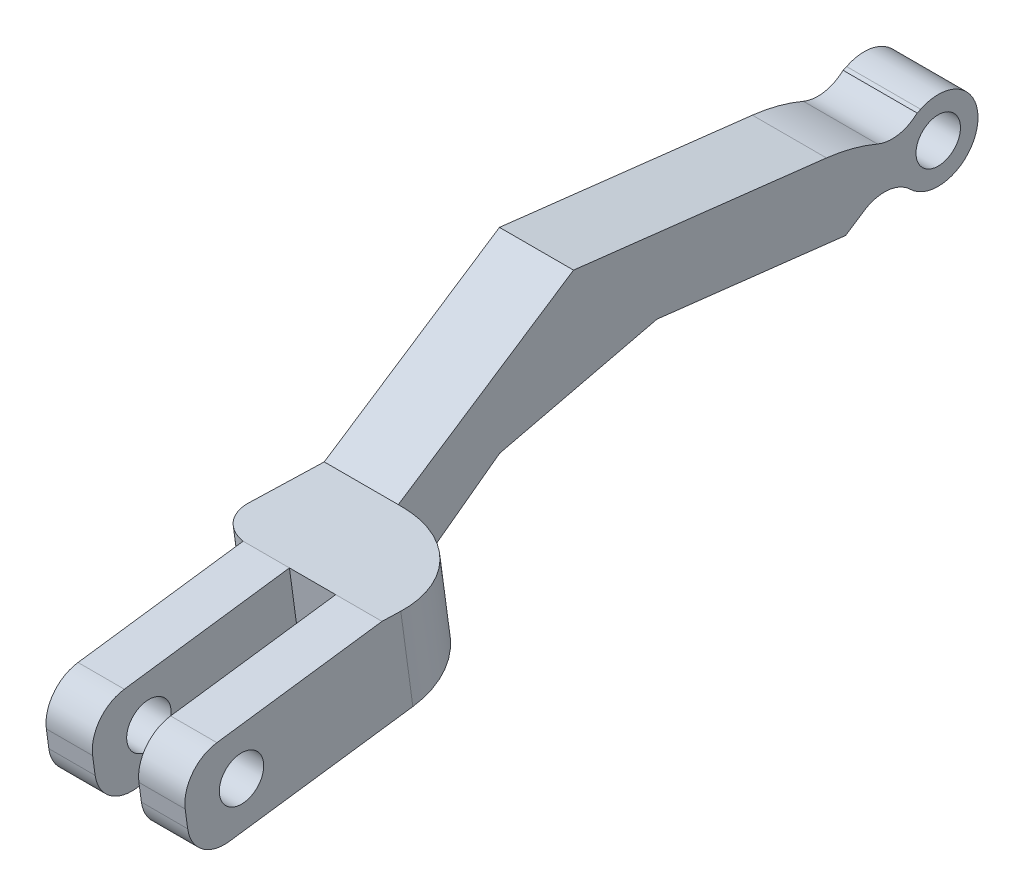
ISO-10303-21;
HEADER;
FILE_DESCRIPTION(('STEP AP214'),'2;1');
FILE_NAME('part.step','',(''),(''),'','','');
FILE_SCHEMA(('AUTOMOTIVE_DESIGN { 1 0 10303 214 1 1 1 1 }'));
ENDSEC;
DATA;
#1=APPLICATION_CONTEXT('core data for automotive mechanical design processes');
#2=APPLICATION_PROTOCOL_DEFINITION('international standard','automotive_design',2000,#1);
#3=PRODUCT_CONTEXT('',#1,'mechanical');
#4=PRODUCT('Part','Part','',(#3));
#5=PRODUCT_RELATED_PRODUCT_CATEGORY('part','',(#4));
#6=PRODUCT_DEFINITION_FORMATION('','',#4);
#7=PRODUCT_DEFINITION_CONTEXT('part definition',#1,'design');
#8=PRODUCT_DEFINITION('design','',#6,#7);
#9=PRODUCT_DEFINITION_SHAPE('','',#8);
#10=(LENGTH_UNIT() NAMED_UNIT(*) SI_UNIT(.MILLI.,.METRE.));
#11=(NAMED_UNIT(*) PLANE_ANGLE_UNIT() SI_UNIT($,.RADIAN.));
#12=(NAMED_UNIT(*) SI_UNIT($,.STERADIAN.) SOLID_ANGLE_UNIT());
#13=UNCERTAINTY_MEASURE_WITH_UNIT(LENGTH_MEASURE(1.E-05),#10,'distance_accuracy_value','');
#14=(GEOMETRIC_REPRESENTATION_CONTEXT(3) GLOBAL_UNCERTAINTY_ASSIGNED_CONTEXT((#13)) GLOBAL_UNIT_ASSIGNED_CONTEXT((#10,
#11,#12)) REPRESENTATION_CONTEXT('',''));
#15=CARTESIAN_POINT('',(0.,0.,0.));
#16=DIRECTION('',(0.,0.,1.));
#17=DIRECTION('',(1.,0.,0.));
#18=AXIS2_PLACEMENT_3D('',#15,#16,#17);
#19=CARTESIAN_POINT('',(2.2,0.,0.));
#20=DIRECTION('',(1.,0.,0.));
#21=DIRECTION('',(0.,0.,-1.));
#22=AXIS2_PLACEMENT_3D('',#19,#20,#21);
#23=PLANE('',#22);
#24=CARTESIAN_POINT('',(2.2,-8.66025403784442,40.));
#25=DIRECTION('',(1.,0.,0.));
#26=DIRECTION('',(0.,0.,-1.));
#27=AXIS2_PLACEMENT_3D('',#24,#25,#26);
#28=CIRCLE('',#27,1.2);
#29=CARTESIAN_POINT('',(2.2,-8.66025403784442,38.8));
#30=VERTEX_POINT('',#29);
#31=EDGE_CURVE('E268',#30,#30,#28,.T.);
#32=ORIENTED_EDGE('',*,*,#31,.F.);
#33=EDGE_LOOP('',(#32));
#34=FACE_BOUND('',#33,.T.);
#35=DIRECTION('',(0.,-0.990856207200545,-0.134922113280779));
#36=VECTOR('',#35,1.);
#37=CARTESIAN_POINT('',(2.2,-5.90995393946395,43.4021851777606));
#38=LINE('',#37,#36);
#39=CARTESIAN_POINT('',(2.2,-8.56959227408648,43.040029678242));
#40=VERTEX_POINT('',#39);
#41=CARTESIAN_POINT('',(2.2,-9.56044848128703,42.9051075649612));
#42=VERTEX_POINT('',#41);
#43=EDGE_CURVE('E283',#40,#42,#38,.T.);
#44=ORIENTED_EDGE('',*,*,#43,.T.);
#45=CARTESIAN_POINT('',(2.2,-9.29060425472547,40.9233951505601));
#46=DIRECTION('',(1.,0.,0.));
#47=DIRECTION('',(0.,0.,-1.));
#48=AXIS2_PLACEMENT_3D('',#45,#46,#47);
#49=CIRCLE('',#48,2.);
#50=CARTESIAN_POINT('',(2.2,-11.2723166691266,40.6535509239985));
#51=VERTEX_POINT('',#50);
#52=EDGE_CURVE('E416',#42,#51,#49,.T.);
#53=ORIENTED_EDGE('',*,*,#52,.T.);
#54=DIRECTION('',(0.,-0.134922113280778,0.990856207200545));
#55=VECTOR('',#54,1.);
#56=CARTESIAN_POINT('',(2.2,-5.6322069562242,-0.766921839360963));
#57=LINE('',#56,#55);
#58=CARTESIAN_POINT('',(2.2,-10.0580176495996,31.7358450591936));
#59=VERTEX_POINT('',#58);
#60=EDGE_CURVE('E263',#59,#51,#57,.T.);
#61=ORIENTED_EDGE('',*,*,#60,.F.);
#62=DIRECTION('',(0.,0.990856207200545,0.134922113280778));
#63=VECTOR('',#62,1.);
#64=CARTESIAN_POINT('',(2.2,-4.42581069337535,32.5027668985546));
#65=LINE('',#64,#63);
#66=CARTESIAN_POINT('',(2.2,-5.10373661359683,32.4104556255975));
#67=VERTEX_POINT('',#66);
#68=EDGE_CURVE('E227',#59,#67,#65,.T.);
#69=ORIENTED_EDGE('',*,*,#68,.T.);
#70=DIRECTION('',(0.,-0.134922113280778,0.990856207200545));
#71=VECTOR('',#70,1.);
#72=CARTESIAN_POINT('',(2.2,-0.67792592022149,-0.092311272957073));
#73=LINE('',#72,#71);
#74=CARTESIAN_POINT('',(2.2,-6.31803563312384,41.3281614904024));
#75=VERTEX_POINT('',#74);
#76=EDGE_CURVE('E280',#67,#75,#73,.T.);
#77=ORIENTED_EDGE('',*,*,#76,.T.);
#78=CARTESIAN_POINT('',(2.2,-8.29974804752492,41.0583172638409));
#79=DIRECTION('',(1.,0.,0.));
#80=DIRECTION('',(0.,0.,-1.));
#81=AXIS2_PLACEMENT_3D('',#78,#79,#80);
#82=CIRCLE('',#81,2.);
#83=EDGE_CURVE('E414',#75,#40,#82,.T.);
#84=ORIENTED_EDGE('',*,*,#83,.T.);
#85=EDGE_LOOP('',(#44,#53,#61,#69,#77,#84));
#86=FACE_BOUND('',#85,.T.);
#87=ADVANCED_FACE('F41',(#34,#86),#23,.T.);
#88=CARTESIAN_POINT('',(2.,0.,0.));
#89=DIRECTION('',(1.,0.,0.));
#90=DIRECTION('',(0.,0.,-1.));
#91=AXIS2_PLACEMENT_3D('',#88,#89,#90);
#92=PLANE('',#91);
#93=CARTESIAN_POINT('',(2.,-2.82842712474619,-2.82842712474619));
#94=DIRECTION('',(1.,0.,0.));
#95=DIRECTION('',(0.,0.,-1.));
#96=AXIS2_PLACEMENT_3D('',#93,#94,#95);
#97=CIRCLE('',#96,1.2);
#98=CARTESIAN_POINT('',(2.,-2.82842712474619,-4.02842712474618));
#99=VERTEX_POINT('',#98);
#100=EDGE_CURVE('E322',#99,#99,#97,.T.);
#101=ORIENTED_EDGE('',*,*,#100,.F.);
#102=EDGE_LOOP('',(#101));
#103=FACE_BOUND('',#102,.T.);
#104=CARTESIAN_POINT('',(2.,0.484049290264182,-0.328427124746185));
#105=DIRECTION('',(1.,0.,0.));
#106=DIRECTION('',(0.,0.,-1.));
#107=AXIS2_PLACEMENT_3D('',#104,#105,#106);
#108=CIRCLE('',#107,2.);
#109=CARTESIAN_POINT('',(2.,-1.35709444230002,0.452719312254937));
#110=VERTEX_POINT('',#109);
#111=CARTESIAN_POINT('',(2.,-0.979731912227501,-1.69127142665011));
#112=VERTEX_POINT('',#111);
#113=EDGE_CURVE('E298',#110,#112,#108,.T.);
#114=ORIENTED_EDGE('',*,*,#113,.F.);
#115=CARTESIAN_POINT('',(2.,-10.562813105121,4.35845149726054));
#116=DIRECTION('',(1.,0.,0.));
#117=DIRECTION('',(0.,0.,-1.));
#118=AXIS2_PLACEMENT_3D('',#115,#116,#117);
#119=CIRCLE('',#118,10.);
#120=CARTESIAN_POINT('',(2.,-0.629231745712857,3.20781629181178));
#121=VERTEX_POINT('',#120);
#122=EDGE_CURVE('E63',#110,#121,#119,.T.);
#123=ORIENTED_EDGE('',*,*,#122,.T.);
#124=DIRECTION('',(0.,0.115063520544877,0.993358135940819));
#125=VECTOR('',#124,1.);
#126=CARTESIAN_POINT('',(2.,-0.987552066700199,0.114390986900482));
#127=LINE('',#126,#125);
#128=CARTESIAN_POINT('',(2.,0.952983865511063,16.8672866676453));
#129=VERTEX_POINT('',#128);
#130=EDGE_CURVE('E300',#121,#129,#127,.T.);
#131=ORIENTED_EDGE('',*,*,#130,.T.);
#132=DIRECTION('',(0.,-0.550374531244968,0.834917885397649));
#133=VECTOR('',#132,1.);
#134=CARTESIAN_POINT('',(2.,8.41512757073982,5.54721844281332));
#135=LINE('',#134,#133);
#136=CARTESIAN_POINT('',(2.,-5.28506014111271,26.3303962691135));
#137=VERTEX_POINT('',#136);
#138=EDGE_CURVE('E302',#129,#137,#135,.T.);
#139=ORIENTED_EDGE('',*,*,#138,.T.);
#140=DIRECTION('',(0.,-0.990856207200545,-0.134922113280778));
#141=VECTOR('',#140,1.);
#142=CARTESIAN_POINT('',(2.,-3.61627801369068,26.5576296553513));
#143=LINE('',#142,#141);
#144=CARTESIAN_POINT('',(2.,-9.24848496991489,25.7907078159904));
#145=VERTEX_POINT('',#144);
#146=EDGE_CURVE('E359',#137,#145,#143,.T.);
#147=ORIENTED_EDGE('',*,*,#146,.T.);
#148=DIRECTION('',(0.,-0.592706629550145,0.805418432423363));
#149=VECTOR('',#148,1.);
#150=CARTESIAN_POINT('',(2.,6.31240513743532,4.64529271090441));
#151=LINE('',#150,#149);
#152=CARTESIAN_POINT('',(2.,-5.61916698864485,20.8588925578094));
#153=VERTEX_POINT('',#152);
#154=EDGE_CURVE('E305',#153,#145,#151,.T.);
#155=ORIENTED_EDGE('',*,*,#154,.F.);
#156=DIRECTION('',(0.,-0.231624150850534,0.972805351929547));
#157=VECTOR('',#156,1.);
#158=CARTESIAN_POINT('',(2.,-5.61916698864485,20.8588925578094));
#159=LINE('',#158,#157);
#160=CARTESIAN_POINT('',(2.,-3.59576628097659,12.3607500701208));
#161=VERTEX_POINT('',#160);
#162=EDGE_CURVE('E431',#153,#161,#159,.F.);
#163=ORIENTED_EDGE('',*,*,#162,.T.);
#164=DIRECTION('',(0.,0.115063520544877,0.993358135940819));
#165=VECTOR('',#164,1.);
#166=CARTESIAN_POINT('',(2.,-4.96098461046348,0.574645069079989));
#167=LINE('',#166,#165);
#168=CARTESIAN_POINT('',(2.,-4.77600788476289,2.17157287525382));
#169=VERTEX_POINT('',#168);
#170=EDGE_CURVE('E307',#169,#161,#167,.T.);
#171=ORIENTED_EDGE('',*,*,#170,.F.);
#172=DIRECTION('',(0.,0.550374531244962,-0.834917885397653));
#173=VECTOR('',#172,1.);
#174=CARTESIAN_POINT('',(2.,-2.33142136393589,-1.53686363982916));
#175=LINE('',#174,#173);
#176=CARTESIAN_POINT('',(2.,-4.12127803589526,1.17834802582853));
#177=VERTEX_POINT('',#176);
#178=EDGE_CURVE('E310',#169,#177,#175,.T.);
#179=ORIENTED_EDGE('',*,*,#178,.T.);
#180=CARTESIAN_POINT('',(2.,-5.79111380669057,0.0775989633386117));
#181=DIRECTION('',(1.,0.,0.));
#182=DIRECTION('',(0.,0.,-1.));
#183=AXIS2_PLACEMENT_3D('',#180,#181,#182);
#184=CIRCLE('',#183,2.);
#185=CARTESIAN_POINT('',(2.,-4.36331299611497,-1.32289553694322));
#186=VERTEX_POINT('',#185);
#187=EDGE_CURVE('E313',#186,#177,#184,.T.);
#188=ORIENTED_EDGE('',*,*,#187,.F.);
#189=CARTESIAN_POINT('',(2.,-2.82842712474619,-2.82842712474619));
#190=DIRECTION('',(1.,0.,0.));
#191=DIRECTION('',(0.,0.,-1.));
#192=AXIS2_PLACEMENT_3D('',#189,#190,#191);
#193=CIRCLE('',#192,2.15);
#194=CARTESIAN_POINT('',(2.,-0.898489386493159,-1.88088275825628));
#195=VERTEX_POINT('',#194);
#196=EDGE_CURVE('E316',#186,#195,#193,.T.);
#197=ORIENTED_EDGE('',*,*,#196,.T.);
#198=CARTESIAN_POINT('',(2.,0.896801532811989,-0.999446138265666));
#199=DIRECTION('',(1.,0.,0.));
#200=DIRECTION('',(0.,0.,-1.));
#201=AXIS2_PLACEMENT_3D('',#198,#199,#200);
#202=CIRCLE('',#201,2.);
#203=EDGE_CURVE('E319',#112,#195,#202,.T.);
#204=ORIENTED_EDGE('',*,*,#203,.F.);
#205=EDGE_LOOP('',(#114,#123,#131,#139,#147,#155,#163,#171,#179,#188,#197,#204));
#206=FACE_BOUND('',#205,.T.);
#207=ADVANCED_FACE('F446',(#103,#206),#92,.T.);
#208=CARTESIAN_POINT('',(-2.,0.484049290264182,-0.328427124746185));
#209=DIRECTION('',(1.,0.,0.));
#210=DIRECTION('',(0.,0.,-1.));
#211=AXIS2_PLACEMENT_3D('',#208,#209,#210);
#212=CYLINDRICAL_SURFACE('',#211,2.);
#213=CARTESIAN_POINT('',(-2.,0.484049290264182,-0.328427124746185));
#214=DIRECTION('',(1.,0.,0.));
#215=DIRECTION('',(0.,0.,-1.));
#216=AXIS2_PLACEMENT_3D('',#213,#214,#215);
#217=CIRCLE('',#216,2.);
#218=CARTESIAN_POINT('',(-2.,-1.35709444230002,0.452719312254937));
#219=VERTEX_POINT('',#218);
#220=CARTESIAN_POINT('',(-2.,-0.979731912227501,-1.69127142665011));
#221=VERTEX_POINT('',#220);
#222=EDGE_CURVE('E325',#219,#221,#217,.T.);
#223=ORIENTED_EDGE('',*,*,#222,.F.);
#224=DIRECTION('',(1.,0.,0.));
#225=VECTOR('',#224,1.);
#226=CARTESIAN_POINT('',(-2.,-1.35709444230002,0.452719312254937));
#227=LINE('',#226,#225);
#228=EDGE_CURVE('E435',#219,#110,#227,.T.);
#229=ORIENTED_EDGE('',*,*,#228,.T.);
#230=ORIENTED_EDGE('',*,*,#113,.T.);
#231=DIRECTION('',(1.,0.,0.));
#232=VECTOR('',#231,1.);
#233=CARTESIAN_POINT('',(-2.,-0.979731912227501,-1.69127142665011));
#234=LINE('',#233,#232);
#235=EDGE_CURVE('E356',#221,#112,#234,.T.);
#236=ORIENTED_EDGE('',*,*,#235,.F.);
#237=EDGE_LOOP('',(#223,#229,#230,#236));
#238=FACE_BOUND('',#237,.T.);
#239=ADVANCED_FACE('F441',(#238),#212,.F.);
#240=CARTESIAN_POINT('',(-2.,0.896801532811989,-0.999446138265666));
#241=DIRECTION('',(1.,0.,0.));
#242=DIRECTION('',(0.,0.,-1.));
#243=AXIS2_PLACEMENT_3D('',#240,#241,#242);
#244=CYLINDRICAL_SURFACE('',#243,2.);
#245=ORIENTED_EDGE('',*,*,#235,.T.);
#246=ORIENTED_EDGE('',*,*,#203,.T.);
#247=DIRECTION('',(1.,0.,0.));
#248=VECTOR('',#247,1.);
#249=CARTESIAN_POINT('',(-2.,-0.898489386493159,-1.88088275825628));
#250=LINE('',#249,#248);
#251=CARTESIAN_POINT('',(-2.,-0.898489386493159,-1.88088275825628));
#252=VERTEX_POINT('',#251);
#253=EDGE_CURVE('E360',#252,#195,#250,.T.);
#254=ORIENTED_EDGE('',*,*,#253,.F.);
#255=CARTESIAN_POINT('',(-2.,0.896801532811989,-0.999446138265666));
#256=DIRECTION('',(1.,0.,0.));
#257=DIRECTION('',(0.,0.,-1.));
#258=AXIS2_PLACEMENT_3D('',#255,#256,#257);
#259=CIRCLE('',#258,2.);
#260=EDGE_CURVE('E350',#221,#252,#259,.T.);
#261=ORIENTED_EDGE('',*,*,#260,.F.);
#262=EDGE_LOOP('',(#245,#246,#254,#261));
#263=FACE_BOUND('',#262,.T.);
#264=ADVANCED_FACE('F451',(#263),#244,.F.);
#265=CARTESIAN_POINT('',(-2.,-2.82842712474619,-2.82842712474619));
#266=DIRECTION('',(1.,0.,0.));
#267=DIRECTION('',(0.,0.,-1.));
#268=AXIS2_PLACEMENT_3D('',#265,#266,#267);
#269=CYLINDRICAL_SURFACE('',#268,2.15);
#270=ORIENTED_EDGE('',*,*,#253,.T.);
#271=ORIENTED_EDGE('',*,*,#196,.F.);
#272=DIRECTION('',(1.,0.,0.));
#273=VECTOR('',#272,1.);
#274=CARTESIAN_POINT('',(-2.,-4.36331299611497,-1.32289553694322));
#275=LINE('',#274,#273);
#276=CARTESIAN_POINT('',(-2.,-4.36331299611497,-1.32289553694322));
#277=VERTEX_POINT('',#276);
#278=EDGE_CURVE('E362',#277,#186,#275,.T.);
#279=ORIENTED_EDGE('',*,*,#278,.F.);
#280=CARTESIAN_POINT('',(-2.,-2.82842712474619,-2.82842712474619));
#281=DIRECTION('',(1.,0.,0.));
#282=DIRECTION('',(0.,0.,-1.));
#283=AXIS2_PLACEMENT_3D('',#280,#281,#282);
#284=CIRCLE('',#283,2.15);
#285=EDGE_CURVE('E347',#277,#252,#284,.T.);
#286=ORIENTED_EDGE('',*,*,#285,.T.);
#287=EDGE_LOOP('',(#270,#271,#279,#286));
#288=FACE_BOUND('',#287,.T.);
#289=ADVANCED_FACE('F504',(#288),#269,.T.);
#290=CARTESIAN_POINT('',(-2.,-5.79111380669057,0.0775989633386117));
#291=DIRECTION('',(1.,0.,0.));
#292=DIRECTION('',(0.,0.,-1.));
#293=AXIS2_PLACEMENT_3D('',#290,#291,#292);
#294=CYLINDRICAL_SURFACE('',#293,2.);
#295=ORIENTED_EDGE('',*,*,#278,.T.);
#296=ORIENTED_EDGE('',*,*,#187,.T.);
#297=DIRECTION('',(1.,0.,0.));
#298=VECTOR('',#297,1.);
#299=CARTESIAN_POINT('',(-2.,-4.12127803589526,1.17834802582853));
#300=LINE('',#299,#298);
#301=CARTESIAN_POINT('',(-2.,-4.12127803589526,1.17834802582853));
#302=VERTEX_POINT('',#301);
#303=EDGE_CURVE('E364',#302,#177,#300,.T.);
#304=ORIENTED_EDGE('',*,*,#303,.F.);
#305=CARTESIAN_POINT('',(-2.,-5.79111380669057,0.0775989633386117));
#306=DIRECTION('',(1.,0.,0.));
#307=DIRECTION('',(0.,0.,-1.));
#308=AXIS2_PLACEMENT_3D('',#305,#306,#307);
#309=CIRCLE('',#308,2.);
#310=EDGE_CURVE('E345',#277,#302,#309,.T.);
#311=ORIENTED_EDGE('',*,*,#310,.F.);
#312=EDGE_LOOP('',(#295,#296,#304,#311));
#313=FACE_BOUND('',#312,.T.);
#314=ADVANCED_FACE('F507',(#313),#294,.F.);
#315=CARTESIAN_POINT('',(-2.,-2.33142136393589,-1.53686363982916));
#316=DIRECTION('',(0.,-0.834917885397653,-0.550374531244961));
#317=DIRECTION('',(0.,0.550374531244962,-0.834917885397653));
#318=AXIS2_PLACEMENT_3D('',#315,#316,#317);
#319=PLANE('',#318);
#320=ORIENTED_EDGE('',*,*,#303,.T.);
#321=ORIENTED_EDGE('',*,*,#178,.F.);
#322=DIRECTION('',(1.,0.,0.));
#323=VECTOR('',#322,1.);
#324=CARTESIAN_POINT('',(-2.,-4.77600788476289,2.17157287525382));
#325=LINE('',#324,#323);
#326=CARTESIAN_POINT('',(-2.,-4.77600788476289,2.17157287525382));
#327=VERTEX_POINT('',#326);
#328=EDGE_CURVE('E366',#327,#169,#325,.T.);
#329=ORIENTED_EDGE('',*,*,#328,.F.);
#330=DIRECTION('',(0.,0.550374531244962,-0.834917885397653));
#331=VECTOR('',#330,1.);
#332=CARTESIAN_POINT('',(-2.,-2.33142136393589,-1.53686363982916));
#333=LINE('',#332,#331);
#334=EDGE_CURVE('E342',#327,#302,#333,.T.);
#335=ORIENTED_EDGE('',*,*,#334,.T.);
#336=EDGE_LOOP('',(#320,#321,#329,#335));
#337=FACE_BOUND('',#336,.T.);
#338=ADVANCED_FACE('F511',(#337),#319,.T.);
#339=CARTESIAN_POINT('',(-2.,-4.96098461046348,0.574645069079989));
#340=DIRECTION('',(0.,0.993358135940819,-0.115063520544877));
#341=DIRECTION('',(0.,0.115063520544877,0.993358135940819));
#342=AXIS2_PLACEMENT_3D('',#339,#340,#341);
#343=PLANE('',#342);
#344=ORIENTED_EDGE('',*,*,#170,.T.);
#345=DIRECTION('',(-1.,0.,0.));
#346=VECTOR('',#345,1.);
#347=CARTESIAN_POINT('',(-2.,-3.59576628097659,12.3607500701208));
#348=LINE('',#347,#346);
#349=CARTESIAN_POINT('',(-2.,-3.59576628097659,12.3607500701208));
#350=VERTEX_POINT('',#349);
#351=EDGE_CURVE('E429',#161,#350,#348,.T.);
#352=ORIENTED_EDGE('',*,*,#351,.T.);
#353=DIRECTION('',(0.,0.115063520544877,0.993358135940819));
#354=VECTOR('',#353,1.);
#355=CARTESIAN_POINT('',(-2.,-4.96098461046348,0.574645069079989));
#356=LINE('',#355,#354);
#357=EDGE_CURVE('E339',#327,#350,#356,.T.);
#358=ORIENTED_EDGE('',*,*,#357,.F.);
#359=ORIENTED_EDGE('',*,*,#328,.T.);
#360=EDGE_LOOP('',(#344,#352,#358,#359));
#361=FACE_BOUND('',#360,.T.);
#362=ADVANCED_FACE('F515',(#361),#343,.F.);
#363=CARTESIAN_POINT('',(-2.,6.31240513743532,4.64529271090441));
#364=DIRECTION('',(0.,0.805418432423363,0.592706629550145));
#365=DIRECTION('',(0.,-0.592706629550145,0.805418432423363));
#366=AXIS2_PLACEMENT_3D('',#363,#364,#365);
#367=PLANE('',#366);
#368=DIRECTION('',(0.,-0.592706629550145,0.805418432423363));
#369=VECTOR('',#368,1.);
#370=CARTESIAN_POINT('',(-2.,6.31240513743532,4.64529271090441));
#371=LINE('',#370,#369);
#372=CARTESIAN_POINT('',(-2.,-5.61916698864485,20.8588925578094));
#373=VERTEX_POINT('',#372);
#374=CARTESIAN_POINT('',(-2.,-9.24848496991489,25.7907078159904));
#375=VERTEX_POINT('',#374);
#376=EDGE_CURVE('E337',#373,#375,#371,.T.);
#377=ORIENTED_EDGE('',*,*,#376,.F.);
#378=DIRECTION('',(1.,0.,0.));
#379=VECTOR('',#378,1.);
#380=CARTESIAN_POINT('',(2.,-5.61916698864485,20.8588925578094));
#381=LINE('',#380,#379);
#382=EDGE_CURVE('E426',#373,#153,#381,.T.);
#383=ORIENTED_EDGE('',*,*,#382,.T.);
#384=ORIENTED_EDGE('',*,*,#154,.T.);
#385=DIRECTION('',(1.,0.,0.));
#386=VECTOR('',#385,1.);
#387=CARTESIAN_POINT('',(-2.,-9.24848496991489,25.7907078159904));
#388=LINE('',#387,#386);
#389=EDGE_CURVE('E368',#375,#145,#388,.T.);
#390=ORIENTED_EDGE('',*,*,#389,.F.);
#391=EDGE_LOOP('',(#377,#383,#384,#390));
#392=FACE_BOUND('',#391,.T.);
#393=ADVANCED_FACE('F519',(#392),#367,.F.);
#394=CARTESIAN_POINT('',(-2.,-5.6322069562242,-0.766921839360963));
#395=DIRECTION('',(0.,0.990856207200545,0.134922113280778));
#396=DIRECTION('',(0.,-0.134922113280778,0.990856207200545));
#397=AXIS2_PLACEMENT_3D('',#394,#395,#396);
#398=PLANE('',#397);
#399=DIRECTION('',(0.,-0.134922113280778,0.990856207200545));
#400=VECTOR('',#399,1.);
#401=CARTESIAN_POINT('',(7.2,-5.6322069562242,-0.766921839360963));
#402=LINE('',#401,#400);
#403=CARTESIAN_POINT('',(7.2,-9.92309553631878,30.7449888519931));
#404=VERTEX_POINT('',#403);
#405=CARTESIAN_POINT('',(7.2,-11.2723166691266,40.6535509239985));
#406=VERTEX_POINT('',#405);
#407=EDGE_CURVE('E254',#404,#406,#402,.T.);
#408=ORIENTED_EDGE('',*,*,#407,.T.);
#409=DIRECTION('',(-1.,0.,0.));
#410=VECTOR('',#409,1.);
#411=CARTESIAN_POINT('',(-2.,-11.2723166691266,40.6535509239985));
#412=LINE('',#411,#410);
#413=CARTESIAN_POINT('',(4.7,-11.2723166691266,40.6535509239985));
#414=VERTEX_POINT('',#413);
#415=EDGE_CURVE('E393',#406,#414,#412,.T.);
#416=ORIENTED_EDGE('',*,*,#415,.T.);
#417=DIRECTION('',(0.,-0.134922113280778,0.990856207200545));
#418=VECTOR('',#417,1.);
#419=CARTESIAN_POINT('',(4.7,-5.6322069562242,-0.766921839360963));
#420=LINE('',#419,#418);
#421=CARTESIAN_POINT('',(4.7,-10.0580176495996,31.7358450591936));
#422=VERTEX_POINT('',#421);
#423=EDGE_CURVE('E246',#422,#414,#420,.T.);
#424=ORIENTED_EDGE('',*,*,#423,.F.);
#425=DIRECTION('',(-1.,0.,0.));
#426=VECTOR('',#425,1.);
#427=CARTESIAN_POINT('',(4.7,-10.0580176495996,31.7358450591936));
#428=LINE('',#427,#426);
#429=EDGE_CURVE('E258',#422,#59,#428,.T.);
#430=ORIENTED_EDGE('',*,*,#429,.T.);
#431=ORIENTED_EDGE('',*,*,#60,.T.);
#432=DIRECTION('',(1.,0.,0.));
#433=VECTOR('',#432,1.);
#434=CARTESIAN_POINT('',(-0.3,-11.2723166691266,40.6535509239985));
#435=LINE('',#434,#433);
#436=CARTESIAN_POINT('',(-0.3,-11.2723166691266,40.6535509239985));
#437=VERTEX_POINT('',#436);
#438=EDGE_CURVE('E391',#51,#437,#435,.F.);
#439=ORIENTED_EDGE('',*,*,#438,.T.);
#440=DIRECTION('',(0.,-0.134922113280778,0.990856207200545));
#441=VECTOR('',#440,1.);
#442=CARTESIAN_POINT('',(-0.3,-5.6322069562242,-0.766921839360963));
#443=LINE('',#442,#441);
#444=CARTESIAN_POINT('',(-0.3,-10.0580176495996,31.7358450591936));
#445=VERTEX_POINT('',#444);
#446=EDGE_CURVE('E264',#445,#437,#443,.T.);
#447=ORIENTED_EDGE('',*,*,#446,.F.);
#448=CARTESIAN_POINT('',(0.,-9.79122644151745,29.7765537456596));
#449=DIRECTION('',(0.,0.990856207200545,0.134922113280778));
#450=DIRECTION('',(0.,-0.134922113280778,0.990856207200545));
#451=AXIS2_PLACEMENT_3D('',#448,#449,#450);
#452=CIRCLE('',#451,2.);
#453=CARTESIAN_POINT('',(-2.,-9.79122644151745,29.7765537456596));
#454=VERTEX_POINT('',#453);
#455=EDGE_CURVE('E377',#445,#454,#452,.F.);
#456=ORIENTED_EDGE('',*,*,#455,.T.);
#457=DIRECTION('',(0.,-0.134922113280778,0.990856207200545));
#458=VECTOR('',#457,1.);
#459=CARTESIAN_POINT('',(-2.,-5.6322069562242,-0.766921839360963));
#460=LINE('',#459,#458);
#461=EDGE_CURVE('E334',#375,#454,#460,.T.);
#462=ORIENTED_EDGE('',*,*,#461,.F.);
#463=ORIENTED_EDGE('',*,*,#389,.T.);
#464=DIRECTION('',(1.,0.,0.));
#465=VECTOR('',#464,1.);
#466=CARTESIAN_POINT('',(-0.3,-9.24848496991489,25.7907078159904));
#467=LINE('',#466,#465);
#468=CARTESIAN_POINT('',(2.2,-9.24848496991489,25.7907078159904));
#469=VERTEX_POINT('',#468);
#470=EDGE_CURVE('E277',#145,#469,#467,.T.);
#471=ORIENTED_EDGE('',*,*,#470,.T.);
#472=CARTESIAN_POINT('',(2.2,-9.92309553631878,30.7449888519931));
#473=DIRECTION('',(0.,0.990856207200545,0.134922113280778));
#474=DIRECTION('',(0.,-0.134922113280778,0.990856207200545));
#475=AXIS2_PLACEMENT_3D('',#472,#473,#474);
#476=CIRCLE('',#475,5.);
#477=EDGE_CURVE('E386',#469,#404,#476,.F.);
#478=ORIENTED_EDGE('',*,*,#477,.T.);
#479=EDGE_LOOP('',(#408,#416,#424,#430,#431,#439,#447,#456,#462,#463,#471,#478));
#480=FACE_BOUND('',#479,.T.);
#481=ADVANCED_FACE('F523',(#480),#398,.F.);
#482=CARTESIAN_POINT('',(-2.,-6.06490845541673,0.180871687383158));
#483=DIRECTION('',(0.,-0.99955560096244,0.0298094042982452));
#484=DIRECTION('',(0.,-0.0298094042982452,-0.99955560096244));
#485=AXIS2_PLACEMENT_3D('',#482,#483,#484);
#486=PLANE('',#485);
#487=DIRECTION('',(0.,-0.0298094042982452,-0.99955560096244));
#488=VECTOR('',#487,1.);
#489=CARTESIAN_POINT('',(7.2,-6.06490845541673,0.180871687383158));
#490=LINE('',#489,#488);
#491=CARTESIAN_POINT('',(7.2,-5.10373661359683,32.4104556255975));
#492=VERTEX_POINT('',#491);
#493=CARTESIAN_POINT('',(7.2,-5.13395720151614,31.3971123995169));
#494=VERTEX_POINT('',#493);
#495=EDGE_CURVE('E220',#492,#494,#490,.T.);
#496=ORIENTED_EDGE('',*,*,#495,.T.);
#497=CARTESIAN_POINT('',(2.2,-5.13395720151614,31.3971123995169));
#498=DIRECTION('',(0.,-0.99955560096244,0.0298094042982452));
#499=DIRECTION('',(0.,0.0298094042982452,0.99955560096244));
#500=AXIS2_PLACEMENT_3D('',#497,#498,#499);
#501=ELLIPSE('',#500,5.06896877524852,5.);
#502=CARTESIAN_POINT('',(2.2,-5.28506014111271,26.3303962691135));
#503=VERTEX_POINT('',#502);
#504=EDGE_CURVE('E389',#494,#503,#501,.F.);
#505=ORIENTED_EDGE('',*,*,#504,.T.);
#506=DIRECTION('',(1.,0.,0.));
#507=VECTOR('',#506,1.);
#508=CARTESIAN_POINT('',(-0.3,-5.28506014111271,26.3303962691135));
#509=LINE('',#508,#507);
#510=EDGE_CURVE('E291',#137,#503,#509,.T.);
#511=ORIENTED_EDGE('',*,*,#510,.F.);
#512=DIRECTION('',(1.,0.,0.));
#513=VECTOR('',#512,1.);
#514=CARTESIAN_POINT('',(-2.,-5.28506014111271,26.3303962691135));
#515=LINE('',#514,#513);
#516=CARTESIAN_POINT('',(-2.,-5.28506014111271,26.3303962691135));
#517=VERTEX_POINT('',#516);
#518=EDGE_CURVE('E371',#517,#137,#515,.T.);
#519=ORIENTED_EDGE('',*,*,#518,.F.);
#520=DIRECTION('',(0.,-0.0298094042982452,-0.99955560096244));
#521=VECTOR('',#520,1.);
#522=CARTESIAN_POINT('',(-2.,-6.06490845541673,0.180871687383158));
#523=LINE('',#522,#521);
#524=CARTESIAN_POINT('',(-2.,-5.1634939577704,30.4066991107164));
#525=VERTEX_POINT('',#524);
#526=EDGE_CURVE('E332',#525,#517,#523,.T.);
#527=ORIENTED_EDGE('',*,*,#526,.F.);
#528=CARTESIAN_POINT('',(0.,-5.1634939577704,30.4066991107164));
#529=DIRECTION('',(0.,-0.99955560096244,0.0298094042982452));
#530=DIRECTION('',(0.,0.0298094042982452,0.99955560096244));
#531=AXIS2_PLACEMENT_3D('',#528,#529,#530);
#532=ELLIPSE('',#531,2.02758751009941,2.);
#533=CARTESIAN_POINT('',(-0.3,-5.10373661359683,32.4104556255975));
#534=VERTEX_POINT('',#533);
#535=EDGE_CURVE('E381',#525,#534,#532,.F.);
#536=ORIENTED_EDGE('',*,*,#535,.T.);
#537=DIRECTION('',(1.,0.,0.));
#538=VECTOR('',#537,1.);
#539=CARTESIAN_POINT('',(-0.3,-5.10373661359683,32.4104556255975));
#540=LINE('',#539,#538);
#541=EDGE_CURVE('E288',#534,#67,#540,.T.);
#542=ORIENTED_EDGE('',*,*,#541,.T.);
#543=DIRECTION('',(-1.,0.,0.));
#544=VECTOR('',#543,1.);
#545=CARTESIAN_POINT('',(4.7,-5.10373661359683,32.4104556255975));
#546=LINE('',#545,#544);
#547=CARTESIAN_POINT('',(4.7,-5.10373661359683,32.4104556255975));
#548=VERTEX_POINT('',#547);
#549=EDGE_CURVE('E223',#548,#67,#546,.T.);
#550=ORIENTED_EDGE('',*,*,#549,.F.);
#551=DIRECTION('',(-1.,0.,0.));
#552=VECTOR('',#551,1.);
#553=CARTESIAN_POINT('',(7.2,-5.10373661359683,32.4104556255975));
#554=LINE('',#553,#552);
#555=EDGE_CURVE('E216',#492,#548,#554,.T.);
#556=ORIENTED_EDGE('',*,*,#555,.F.);
#557=EDGE_LOOP('',(#496,#505,#511,#519,#527,#536,#542,#550,#556));
#558=FACE_BOUND('',#557,.T.);
#559=ADVANCED_FACE('F218',(#558),#486,.F.);
#560=CARTESIAN_POINT('',(-2.,8.41512757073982,5.54721844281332));
#561=DIRECTION('',(0.,0.834917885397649,0.550374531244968));
#562=DIRECTION('',(0.,-0.550374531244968,0.834917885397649));
#563=AXIS2_PLACEMENT_3D('',#560,#561,#562);
#564=PLANE('',#563);
#565=ORIENTED_EDGE('',*,*,#518,.T.);
#566=ORIENTED_EDGE('',*,*,#138,.F.);
#567=DIRECTION('',(1.,0.,0.));
#568=VECTOR('',#567,1.);
#569=CARTESIAN_POINT('',(-2.,0.952983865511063,16.8672866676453));
#570=LINE('',#569,#568);
#571=CARTESIAN_POINT('',(-2.,0.952983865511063,16.8672866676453));
#572=VERTEX_POINT('',#571);
#573=EDGE_CURVE('E355',#572,#129,#570,.T.);
#574=ORIENTED_EDGE('',*,*,#573,.F.);
#575=DIRECTION('',(0.,-0.550374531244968,0.834917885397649));
#576=VECTOR('',#575,1.);
#577=CARTESIAN_POINT('',(-2.,8.41512757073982,5.54721844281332));
#578=LINE('',#577,#576);
#579=EDGE_CURVE('E329',#572,#517,#578,.T.);
#580=ORIENTED_EDGE('',*,*,#579,.T.);
#581=EDGE_LOOP('',(#565,#566,#574,#580));
#582=FACE_BOUND('',#581,.T.);
#583=ADVANCED_FACE('F530',(#582),#564,.T.);
#584=CARTESIAN_POINT('',(-2.,-0.987552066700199,0.114390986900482));
#585=DIRECTION('',(0.,0.993358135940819,-0.115063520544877));
#586=DIRECTION('',(0.,0.115063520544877,0.993358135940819));
#587=AXIS2_PLACEMENT_3D('',#584,#585,#586);
#588=PLANE('',#587);
#589=ORIENTED_EDGE('',*,*,#130,.F.);
#590=DIRECTION('',(-1.,0.,0.));
#591=VECTOR('',#590,1.);
#592=CARTESIAN_POINT('',(-2.,-0.629231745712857,3.20781629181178));
#593=LINE('',#592,#591);
#594=CARTESIAN_POINT('',(-2.,-0.629231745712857,3.20781629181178));
#595=VERTEX_POINT('',#594);
#596=EDGE_CURVE('E49',#121,#595,#593,.T.);
#597=ORIENTED_EDGE('',*,*,#596,.T.);
#598=DIRECTION('',(0.,0.115063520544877,0.993358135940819));
#599=VECTOR('',#598,1.);
#600=CARTESIAN_POINT('',(-2.,-0.987552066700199,0.114390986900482));
#601=LINE('',#600,#599);
#602=EDGE_CURVE('E327',#595,#572,#601,.T.);
#603=ORIENTED_EDGE('',*,*,#602,.T.);
#604=ORIENTED_EDGE('',*,*,#573,.T.);
#605=EDGE_LOOP('',(#589,#597,#603,#604));
#606=FACE_BOUND('',#605,.T.);
#607=ADVANCED_FACE('F500',(#606),#588,.T.);
#608=CARTESIAN_POINT('',(-2.,-2.82842712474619,-2.82842712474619));
#609=DIRECTION('',(1.,0.,0.));
#610=DIRECTION('',(0.,0.,-1.));
#611=AXIS2_PLACEMENT_3D('',#608,#609,#610);
#612=CYLINDRICAL_SURFACE('',#611,1.2);
#613=CARTESIAN_POINT('',(-2.,-2.82842712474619,-2.82842712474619));
#614=DIRECTION('',(1.,0.,0.));
#615=DIRECTION('',(0.,0.,-1.));
#616=AXIS2_PLACEMENT_3D('',#613,#614,#615);
#617=CIRCLE('',#616,1.2);
#618=CARTESIAN_POINT('',(-2.,-2.82842712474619,-4.02842712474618));
#619=VERTEX_POINT('',#618);
#620=EDGE_CURVE('E352',#619,#619,#617,.T.);
#621=ORIENTED_EDGE('',*,*,#620,.F.);
#622=EDGE_LOOP('',(#621));
#623=FACE_BOUND('',#622,.T.);
#624=ORIENTED_EDGE('',*,*,#100,.T.);
#625=EDGE_LOOP('',(#624));
#626=FACE_BOUND('',#625,.T.);
#627=ADVANCED_FACE('F497',(#623,#626),#612,.F.);
#628=CARTESIAN_POINT('',(-2.,0.,0.));
#629=DIRECTION('',(1.,0.,0.));
#630=DIRECTION('',(0.,0.,-1.));
#631=AXIS2_PLACEMENT_3D('',#628,#629,#630);
#632=PLANE('',#631);
#633=ORIENTED_EDGE('',*,*,#602,.F.);
#634=CARTESIAN_POINT('',(-2.,-10.562813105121,4.35845149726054));
#635=DIRECTION('',(1.,0.,0.));
#636=DIRECTION('',(0.,0.,-1.));
#637=AXIS2_PLACEMENT_3D('',#634,#635,#636);
#638=CIRCLE('',#637,10.);
#639=EDGE_CURVE('E11',#595,#219,#638,.F.);
#640=ORIENTED_EDGE('',*,*,#639,.T.);
#641=ORIENTED_EDGE('',*,*,#222,.T.);
#642=ORIENTED_EDGE('',*,*,#260,.T.);
#643=ORIENTED_EDGE('',*,*,#285,.F.);
#644=ORIENTED_EDGE('',*,*,#310,.T.);
#645=ORIENTED_EDGE('',*,*,#334,.F.);
#646=ORIENTED_EDGE('',*,*,#357,.T.);
#647=DIRECTION('',(0.,0.231624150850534,-0.972805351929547));
#648=VECTOR('',#647,1.);
#649=CARTESIAN_POINT('',(-2.,-0.617665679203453,-0.147065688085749));
#650=LINE('',#649,#648);
#651=EDGE_CURVE('E433',#350,#373,#650,.F.);
#652=ORIENTED_EDGE('',*,*,#651,.T.);
#653=ORIENTED_EDGE('',*,*,#376,.T.);
#654=ORIENTED_EDGE('',*,*,#461,.T.);
#655=DIRECTION('',(0.,0.990856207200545,0.134922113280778));
#656=VECTOR('',#655,1.);
#657=CARTESIAN_POINT('',(-2.,-4.15901948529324,30.5434755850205));
#658=LINE('',#657,#656);
#659=EDGE_CURVE('E379',#454,#525,#658,.T.);
#660=ORIENTED_EDGE('',*,*,#659,.T.);
#661=ORIENTED_EDGE('',*,*,#526,.T.);
#662=ORIENTED_EDGE('',*,*,#579,.F.);
#663=EDGE_LOOP('',(#633,#640,#641,#642,#643,#644,#645,#646,#652,#653,#654,#660,#661,#662));
#664=FACE_BOUND('',#663,.T.);
#665=ORIENTED_EDGE('',*,*,#620,.T.);
#666=EDGE_LOOP('',(#665));
#667=FACE_BOUND('',#666,.T.);
#668=ADVANCED_FACE('F455',(#664,#667),#632,.F.);
#669=CARTESIAN_POINT('',(-0.3,-5.90995393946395,43.4021851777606));
#670=DIRECTION('',(0.,-0.134922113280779,0.990856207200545));
#671=DIRECTION('',(0.,-0.990856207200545,-0.134922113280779));
#672=AXIS2_PLACEMENT_3D('',#669,#670,#671);
#673=PLANE('',#672);
#674=DIRECTION('',(0.,-0.990856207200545,-0.134922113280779));
#675=VECTOR('',#674,1.);
#676=CARTESIAN_POINT('',(-0.3,-5.90995393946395,43.4021851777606));
#677=LINE('',#676,#675);
#678=CARTESIAN_POINT('',(-0.3,-8.56959227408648,43.040029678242));
#679=VERTEX_POINT('',#678);
#680=CARTESIAN_POINT('',(-0.3,-9.56044848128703,42.9051075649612));
#681=VERTEX_POINT('',#680);
#682=EDGE_CURVE('E271',#679,#681,#677,.T.);
#683=ORIENTED_EDGE('',*,*,#682,.T.);
#684=DIRECTION('',(1.,0.,0.));
#685=VECTOR('',#684,1.);
#686=CARTESIAN_POINT('',(2.2,-9.56044848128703,42.9051075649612));
#687=LINE('',#686,#685);
#688=EDGE_CURVE('E411',#681,#42,#687,.T.);
#689=ORIENTED_EDGE('',*,*,#688,.T.);
#690=ORIENTED_EDGE('',*,*,#43,.F.);
#691=DIRECTION('',(1.,0.,0.));
#692=VECTOR('',#691,1.);
#693=CARTESIAN_POINT('',(-0.3,-8.56959227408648,43.040029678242));
#694=LINE('',#693,#692);
#695=EDGE_CURVE('E409',#40,#679,#694,.F.);
#696=ORIENTED_EDGE('',*,*,#695,.T.);
#697=EDGE_LOOP('',(#683,#689,#690,#696));
#698=FACE_BOUND('',#697,.T.);
#699=ADVANCED_FACE('F484',(#698),#673,.T.);
#700=CARTESIAN_POINT('',(-0.3,-0.67792592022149,-0.092311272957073));
#701=DIRECTION('',(0.,0.990856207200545,0.134922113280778));
#702=DIRECTION('',(0.,-0.134922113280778,0.990856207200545));
#703=AXIS2_PLACEMENT_3D('',#700,#701,#702);
#704=PLANE('',#703);
#705=DIRECTION('',(0.,-0.134922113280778,0.990856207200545));
#706=VECTOR('',#705,1.);
#707=CARTESIAN_POINT('',(-0.3,-0.67792592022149,-0.092311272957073));
#708=LINE('',#707,#706);
#709=CARTESIAN_POINT('',(-0.3,-6.31803563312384,41.3281614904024));
#710=VERTEX_POINT('',#709);
#711=EDGE_CURVE('E267',#534,#710,#708,.T.);
#712=ORIENTED_EDGE('',*,*,#711,.T.);
#713=DIRECTION('',(1.,0.,0.));
#714=VECTOR('',#713,1.);
#715=CARTESIAN_POINT('',(-0.3,-6.31803563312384,41.3281614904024));
#716=LINE('',#715,#714);
#717=EDGE_CURVE('E422',#710,#75,#716,.T.);
#718=ORIENTED_EDGE('',*,*,#717,.T.);
#719=ORIENTED_EDGE('',*,*,#76,.F.);
#720=ORIENTED_EDGE('',*,*,#541,.F.);
#721=EDGE_LOOP('',(#712,#718,#719,#720));
#722=FACE_BOUND('',#721,.T.);
#723=ADVANCED_FACE('F487',(#722),#704,.T.);
#724=CARTESIAN_POINT('',(-0.3,-3.61627801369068,26.5576296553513));
#725=DIRECTION('',(0.,-0.134922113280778,0.990856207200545));
#726=DIRECTION('',(0.,-0.990856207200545,-0.134922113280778));
#727=AXIS2_PLACEMENT_3D('',#724,#725,#726);
#728=PLANE('',#727);
#729=ORIENTED_EDGE('',*,*,#510,.T.);
#730=DIRECTION('',(0.,-0.990856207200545,-0.134922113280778));
#731=VECTOR('',#730,1.);
#732=CARTESIAN_POINT('',(2.2,-9.24848496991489,25.7907078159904));
#733=LINE('',#732,#731);
#734=EDGE_CURVE('E383',#503,#469,#733,.T.);
#735=ORIENTED_EDGE('',*,*,#734,.T.);
#736=ORIENTED_EDGE('',*,*,#470,.F.);
#737=ORIENTED_EDGE('',*,*,#146,.F.);
#738=EDGE_LOOP('',(#729,#735,#736,#737));
#739=FACE_BOUND('',#738,.T.);
#740=ADVANCED_FACE('F482',(#739),#728,.F.);
#741=CARTESIAN_POINT('',(-0.3,-8.66025403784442,40.));
#742=DIRECTION('',(1.,0.,0.));
#743=DIRECTION('',(0.,0.,-1.));
#744=AXIS2_PLACEMENT_3D('',#741,#742,#743);
#745=CYLINDRICAL_SURFACE('',#744,1.2);
#746=CARTESIAN_POINT('',(-0.3,-8.66025403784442,40.));
#747=DIRECTION('',(1.,0.,0.));
#748=DIRECTION('',(0.,0.,-1.));
#749=AXIS2_PLACEMENT_3D('',#746,#747,#748);
#750=CIRCLE('',#749,1.2);
#751=CARTESIAN_POINT('',(-0.3,-8.66025403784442,38.8));
#752=VERTEX_POINT('',#751);
#753=EDGE_CURVE('E274',#752,#752,#750,.T.);
#754=ORIENTED_EDGE('',*,*,#753,.F.);
#755=EDGE_LOOP('',(#754));
#756=FACE_BOUND('',#755,.T.);
#757=ORIENTED_EDGE('',*,*,#31,.T.);
#758=EDGE_LOOP('',(#757));
#759=FACE_BOUND('',#758,.T.);
#760=ADVANCED_FACE('F479',(#756,#759),#745,.F.);
#761=CARTESIAN_POINT('',(-0.3,0.,0.));
#762=DIRECTION('',(1.,0.,0.));
#763=DIRECTION('',(0.,0.,-1.));
#764=AXIS2_PLACEMENT_3D('',#761,#762,#763);
#765=PLANE('',#764);
#766=ORIENTED_EDGE('',*,*,#446,.T.);
#767=CARTESIAN_POINT('',(-0.3,-9.29060425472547,40.9233951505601));
#768=DIRECTION('',(1.,0.,0.));
#769=DIRECTION('',(0.,0.,-1.));
#770=AXIS2_PLACEMENT_3D('',#767,#768,#769);
#771=CIRCLE('',#770,2.);
#772=EDGE_CURVE('E420',#437,#681,#771,.F.);
#773=ORIENTED_EDGE('',*,*,#772,.T.);
#774=ORIENTED_EDGE('',*,*,#682,.F.);
#775=CARTESIAN_POINT('',(-0.3,-8.29974804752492,41.0583172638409));
#776=DIRECTION('',(1.,0.,0.));
#777=DIRECTION('',(0.,0.,-1.));
#778=AXIS2_PLACEMENT_3D('',#775,#776,#777);
#779=CIRCLE('',#778,2.);
#780=EDGE_CURVE('E418',#679,#710,#779,.F.);
#781=ORIENTED_EDGE('',*,*,#780,.T.);
#782=ORIENTED_EDGE('',*,*,#711,.F.);
#783=DIRECTION('',(0.,0.990856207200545,0.134922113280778));
#784=VECTOR('',#783,1.);
#785=CARTESIAN_POINT('',(-0.3,-4.42581069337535,32.5027668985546));
#786=LINE('',#785,#784);
#787=EDGE_CURVE('E290',#445,#534,#786,.T.);
#788=ORIENTED_EDGE('',*,*,#787,.F.);
#789=EDGE_LOOP('',(#766,#773,#774,#781,#782,#788));
#790=FACE_BOUND('',#789,.T.);
#791=ORIENTED_EDGE('',*,*,#753,.T.);
#792=EDGE_LOOP('',(#791));
#793=FACE_BOUND('',#792,.T.);
#794=ADVANCED_FACE('F477',(#790,#793),#765,.F.);
#795=CARTESIAN_POINT('',(4.7,-4.42581069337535,32.5027668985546));
#796=DIRECTION('',(0.,-0.134922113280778,0.990856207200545));
#797=DIRECTION('',(0.,-0.990856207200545,-0.134922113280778));
#798=AXIS2_PLACEMENT_3D('',#795,#796,#797);
#799=PLANE('',#798);
#800=ORIENTED_EDGE('',*,*,#68,.F.);
#801=ORIENTED_EDGE('',*,*,#429,.F.);
#802=DIRECTION('',(0.,0.990856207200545,0.134922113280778));
#803=VECTOR('',#802,1.);
#804=CARTESIAN_POINT('',(4.7,-4.42581069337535,32.5027668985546));
#805=LINE('',#804,#803);
#806=EDGE_CURVE('E256',#422,#548,#805,.T.);
#807=ORIENTED_EDGE('',*,*,#806,.T.);
#808=ORIENTED_EDGE('',*,*,#549,.T.);
#809=EDGE_LOOP('',(#800,#801,#807,#808));
#810=FACE_BOUND('',#809,.T.);
#811=ADVANCED_FACE('F599',(#810),#799,.T.);
#812=CARTESIAN_POINT('',(7.2,-0.67792592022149,-0.092311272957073));
#813=DIRECTION('',(0.,-0.990856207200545,-0.134922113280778));
#814=DIRECTION('',(0.,0.134922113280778,-0.990856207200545));
#815=AXIS2_PLACEMENT_3D('',#812,#813,#814);
#816=PLANE('',#815);
#817=DIRECTION('',(0.,-0.134922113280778,0.990856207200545));
#818=VECTOR('',#817,1.);
#819=CARTESIAN_POINT('',(4.7,-0.67792592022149,-0.092311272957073));
#820=LINE('',#819,#818);
#821=CARTESIAN_POINT('',(4.7,-6.31803563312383,41.3281614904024));
#822=VERTEX_POINT('',#821);
#823=EDGE_CURVE('E253',#548,#822,#820,.T.);
#824=ORIENTED_EDGE('',*,*,#823,.T.);
#825=DIRECTION('',(-1.,0.,0.));
#826=VECTOR('',#825,1.);
#827=CARTESIAN_POINT('',(7.2,-6.31803563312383,41.3281614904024));
#828=LINE('',#827,#826);
#829=CARTESIAN_POINT('',(7.2,-6.31803563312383,41.3281614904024));
#830=VERTEX_POINT('',#829);
#831=EDGE_CURVE('E233',#822,#830,#828,.F.);
#832=ORIENTED_EDGE('',*,*,#831,.T.);
#833=DIRECTION('',(0.,-0.134922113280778,0.990856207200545));
#834=VECTOR('',#833,1.);
#835=CARTESIAN_POINT('',(7.2,-0.67792592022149,-0.092311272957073));
#836=LINE('',#835,#834);
#837=EDGE_CURVE('E230',#492,#830,#836,.T.);
#838=ORIENTED_EDGE('',*,*,#837,.F.);
#839=ORIENTED_EDGE('',*,*,#555,.T.);
#840=EDGE_LOOP('',(#824,#832,#838,#839));
#841=FACE_BOUND('',#840,.T.);
#842=ADVANCED_FACE('F231',(#841),#816,.F.);
#843=CARTESIAN_POINT('',(7.2,-5.90995393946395,43.4021851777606));
#844=DIRECTION('',(0.,0.134922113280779,-0.990856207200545));
#845=DIRECTION('',(0.,0.990856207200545,0.134922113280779));
#846=AXIS2_PLACEMENT_3D('',#843,#844,#845);
#847=PLANE('',#846);
#848=DIRECTION('',(0.,-0.990856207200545,-0.134922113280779));
#849=VECTOR('',#848,1.);
#850=CARTESIAN_POINT('',(4.7,-5.90995393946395,43.4021851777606));
#851=LINE('',#850,#849);
#852=CARTESIAN_POINT('',(4.7,-8.56959227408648,43.040029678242));
#853=VERTEX_POINT('',#852);
#854=CARTESIAN_POINT('',(4.7,-9.56044848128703,42.9051075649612));
#855=VERTEX_POINT('',#854);
#856=EDGE_CURVE('E249',#853,#855,#851,.T.);
#857=ORIENTED_EDGE('',*,*,#856,.T.);
#858=DIRECTION('',(-1.,0.,0.));
#859=VECTOR('',#858,1.);
#860=CARTESIAN_POINT('',(7.2,-9.56044848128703,42.9051075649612));
#861=LINE('',#860,#859);
#862=CARTESIAN_POINT('',(7.2,-9.56044848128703,42.9051075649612));
#863=VERTEX_POINT('',#862);
#864=EDGE_CURVE('E403',#855,#863,#861,.F.);
#865=ORIENTED_EDGE('',*,*,#864,.T.);
#866=DIRECTION('',(0.,-0.990856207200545,-0.134922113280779));
#867=VECTOR('',#866,1.);
#868=CARTESIAN_POINT('',(7.2,-5.90995393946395,43.4021851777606));
#869=LINE('',#868,#867);
#870=CARTESIAN_POINT('',(7.2,-8.56959227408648,43.040029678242));
#871=VERTEX_POINT('',#870);
#872=EDGE_CURVE('E236',#871,#863,#869,.T.);
#873=ORIENTED_EDGE('',*,*,#872,.F.);
#874=DIRECTION('',(-1.,0.,0.));
#875=VECTOR('',#874,1.);
#876=CARTESIAN_POINT('',(7.2,-8.56959227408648,43.040029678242));
#877=LINE('',#876,#875);
#878=EDGE_CURVE('E400',#871,#853,#877,.T.);
#879=ORIENTED_EDGE('',*,*,#878,.T.);
#880=EDGE_LOOP('',(#857,#865,#873,#879));
#881=FACE_BOUND('',#880,.T.);
#882=ADVANCED_FACE('F570',(#881),#847,.F.);
#883=CARTESIAN_POINT('',(7.2,0.,0.));
#884=DIRECTION('',(1.,0.,0.));
#885=DIRECTION('',(0.,0.,-1.));
#886=AXIS2_PLACEMENT_3D('',#883,#884,#885);
#887=PLANE('',#886);
#888=CARTESIAN_POINT('',(7.2,-8.66025403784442,40.));
#889=DIRECTION('',(-1.,0.,0.));
#890=DIRECTION('',(0.,0.,1.));
#891=AXIS2_PLACEMENT_3D('',#888,#889,#890);
#892=CIRCLE('',#891,1.2);
#893=CARTESIAN_POINT('',(7.2,-8.66025403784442,41.2));
#894=VERTEX_POINT('',#893);
#895=EDGE_CURVE('E250',#894,#894,#892,.T.);
#896=ORIENTED_EDGE('',*,*,#895,.T.);
#897=EDGE_LOOP('',(#896));
#898=FACE_BOUND('',#897,.T.);
#899=ORIENTED_EDGE('',*,*,#872,.T.);
#900=CARTESIAN_POINT('',(7.2,-9.29060425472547,40.9233951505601));
#901=DIRECTION('',(1.,0.,0.));
#902=DIRECTION('',(0.,0.,-1.));
#903=AXIS2_PLACEMENT_3D('',#900,#901,#902);
#904=CIRCLE('',#903,2.);
#905=EDGE_CURVE('E407',#863,#406,#904,.T.);
#906=ORIENTED_EDGE('',*,*,#905,.T.);
#907=ORIENTED_EDGE('',*,*,#407,.F.);
#908=DIRECTION('',(0.,-0.990856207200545,-0.134922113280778));
#909=VECTOR('',#908,1.);
#910=CARTESIAN_POINT('',(7.2,-5.9596707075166,31.2846773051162));
#911=LINE('',#910,#909);
#912=EDGE_CURVE('E242',#404,#494,#911,.F.);
#913=ORIENTED_EDGE('',*,*,#912,.T.);
#914=ORIENTED_EDGE('',*,*,#495,.F.);
#915=ORIENTED_EDGE('',*,*,#837,.T.);
#916=CARTESIAN_POINT('',(7.2,-8.29974804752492,41.0583172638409));
#917=DIRECTION('',(1.,0.,0.));
#918=DIRECTION('',(0.,0.,-1.));
#919=AXIS2_PLACEMENT_3D('',#916,#917,#918);
#920=CIRCLE('',#919,2.);
#921=EDGE_CURVE('E405',#830,#871,#920,.T.);
#922=ORIENTED_EDGE('',*,*,#921,.T.);
#923=EDGE_LOOP('',(#899,#906,#907,#913,#914,#915,#922));
#924=FACE_BOUND('',#923,.T.);
#925=ADVANCED_FACE('F239',(#898,#924),#887,.T.);
#926=CARTESIAN_POINT('',(4.7,0.,0.));
#927=DIRECTION('',(1.,0.,0.));
#928=DIRECTION('',(0.,0.,-1.));
#929=AXIS2_PLACEMENT_3D('',#926,#927,#928);
#930=PLANE('',#929);
#931=ORIENTED_EDGE('',*,*,#423,.T.);
#932=CARTESIAN_POINT('',(4.7,-9.29060425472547,40.9233951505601));
#933=DIRECTION('',(1.,0.,0.));
#934=DIRECTION('',(0.,0.,-1.));
#935=AXIS2_PLACEMENT_3D('',#932,#933,#934);
#936=CIRCLE('',#935,2.);
#937=EDGE_CURVE('E398',#414,#855,#936,.F.);
#938=ORIENTED_EDGE('',*,*,#937,.T.);
#939=ORIENTED_EDGE('',*,*,#856,.F.);
#940=CARTESIAN_POINT('',(4.7,-8.29974804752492,41.0583172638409));
#941=DIRECTION('',(1.,0.,0.));
#942=DIRECTION('',(0.,0.,-1.));
#943=AXIS2_PLACEMENT_3D('',#940,#941,#942);
#944=CIRCLE('',#943,2.);
#945=EDGE_CURVE('E396',#853,#822,#944,.F.);
#946=ORIENTED_EDGE('',*,*,#945,.T.);
#947=ORIENTED_EDGE('',*,*,#823,.F.);
#948=ORIENTED_EDGE('',*,*,#806,.F.);
#949=EDGE_LOOP('',(#931,#938,#939,#946,#947,#948));
#950=FACE_BOUND('',#949,.T.);
#951=CARTESIAN_POINT('',(4.7,-8.66025403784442,40.));
#952=DIRECTION('',(-1.,0.,0.));
#953=DIRECTION('',(0.,0.,1.));
#954=AXIS2_PLACEMENT_3D('',#951,#952,#953);
#955=CIRCLE('',#954,1.2);
#956=CARTESIAN_POINT('',(4.7,-8.66025403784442,41.2));
#957=VERTEX_POINT('',#956);
#958=EDGE_CURVE('E576',#957,#957,#955,.T.);
#959=ORIENTED_EDGE('',*,*,#958,.F.);
#960=EDGE_LOOP('',(#959));
#961=FACE_BOUND('',#960,.T.);
#962=ADVANCED_FACE('F585',(#950,#961),#930,.F.);
#963=CARTESIAN_POINT('',(7.2,-8.66025403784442,40.));
#964=DIRECTION('',(-1.,0.,0.));
#965=DIRECTION('',(0.,0.,1.));
#966=AXIS2_PLACEMENT_3D('',#963,#964,#965);
#967=CYLINDRICAL_SURFACE('',#966,1.2);
#968=CARTESIAN_POINT('',(7.2,-8.66025403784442,41.2));
#969=CARTESIAN_POINT('',(7.17395833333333,-8.66025403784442,41.2));
#970=CARTESIAN_POINT('',(7.14791666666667,-8.66025403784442,41.2));
#971=CARTESIAN_POINT('',(7.09583333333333,-8.66025403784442,41.2));
#972=CARTESIAN_POINT('',(7.06979166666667,-8.66025403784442,41.2));
#973=CARTESIAN_POINT('',(7.01770833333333,-8.66025403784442,41.2));
#974=CARTESIAN_POINT('',(6.99166666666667,-8.66025403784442,41.2));
#975=CARTESIAN_POINT('',(6.93958333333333,-8.66025403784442,41.2));
#976=CARTESIAN_POINT('',(6.91354166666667,-8.66025403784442,41.2));
#977=CARTESIAN_POINT('',(6.86145833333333,-8.66025403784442,41.2));
#978=CARTESIAN_POINT('',(6.83541666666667,-8.66025403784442,41.2));
#979=CARTESIAN_POINT('',(6.78333333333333,-8.66025403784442,41.2));
#980=CARTESIAN_POINT('',(6.75729166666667,-8.66025403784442,41.2));
#981=CARTESIAN_POINT('',(6.70520833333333,-8.66025403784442,41.2));
#982=CARTESIAN_POINT('',(6.67916666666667,-8.66025403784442,41.2));
#983=CARTESIAN_POINT('',(6.62708333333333,-8.66025403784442,41.2));
#984=CARTESIAN_POINT('',(6.60104166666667,-8.66025403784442,41.2));
#985=CARTESIAN_POINT('',(6.54895833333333,-8.66025403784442,41.2));
#986=CARTESIAN_POINT('',(6.52291666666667,-8.66025403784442,41.2));
#987=CARTESIAN_POINT('',(6.47083333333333,-8.66025403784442,41.2));
#988=CARTESIAN_POINT('',(6.44479166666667,-8.66025403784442,41.2));
#989=CARTESIAN_POINT('',(6.39270833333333,-8.66025403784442,41.2));
#990=CARTESIAN_POINT('',(6.36666666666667,-8.66025403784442,41.2));
#991=CARTESIAN_POINT('',(6.31458333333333,-8.66025403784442,41.2));
#992=CARTESIAN_POINT('',(6.28854166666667,-8.66025403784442,41.2));
#993=CARTESIAN_POINT('',(6.23645833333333,-8.66025403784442,41.2));
#994=CARTESIAN_POINT('',(6.21041666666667,-8.66025403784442,41.2));
#995=CARTESIAN_POINT('',(6.15833333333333,-8.66025403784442,41.2));
#996=CARTESIAN_POINT('',(6.13229166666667,-8.66025403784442,41.2));
#997=CARTESIAN_POINT('',(6.08020833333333,-8.66025403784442,41.2));
#998=CARTESIAN_POINT('',(6.05416666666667,-8.66025403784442,41.2));
#999=CARTESIAN_POINT('',(6.00208333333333,-8.66025403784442,41.2));
#1000=CARTESIAN_POINT('',(5.97604166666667,-8.66025403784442,41.2));
#1001=CARTESIAN_POINT('',(5.92395833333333,-8.66025403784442,41.2));
#1002=CARTESIAN_POINT('',(5.89791666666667,-8.66025403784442,41.2));
#1003=CARTESIAN_POINT('',(5.84583333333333,-8.66025403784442,41.2));
#1004=CARTESIAN_POINT('',(5.81979166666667,-8.66025403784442,41.2));
#1005=CARTESIAN_POINT('',(5.76770833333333,-8.66025403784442,41.2));
#1006=CARTESIAN_POINT('',(5.74166666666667,-8.66025403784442,41.2));
#1007=CARTESIAN_POINT('',(5.68958333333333,-8.66025403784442,41.2));
#1008=CARTESIAN_POINT('',(5.66354166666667,-8.66025403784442,41.2));
#1009=CARTESIAN_POINT('',(5.61145833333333,-8.66025403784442,41.2));
#1010=CARTESIAN_POINT('',(5.58541666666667,-8.66025403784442,41.2));
#1011=CARTESIAN_POINT('',(5.53333333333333,-8.66025403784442,41.2));
#1012=CARTESIAN_POINT('',(5.50729166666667,-8.66025403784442,41.2));
#1013=CARTESIAN_POINT('',(5.45520833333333,-8.66025403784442,41.2));
#1014=CARTESIAN_POINT('',(5.42916666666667,-8.66025403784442,41.2));
#1015=CARTESIAN_POINT('',(5.37708333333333,-8.66025403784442,41.2));
#1016=CARTESIAN_POINT('',(5.35104166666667,-8.66025403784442,41.2));
#1017=CARTESIAN_POINT('',(5.29895833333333,-8.66025403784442,41.2));
#1018=CARTESIAN_POINT('',(5.27291666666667,-8.66025403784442,41.2));
#1019=CARTESIAN_POINT('',(5.22083333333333,-8.66025403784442,41.2));
#1020=CARTESIAN_POINT('',(5.19479166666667,-8.66025403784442,41.2));
#1021=CARTESIAN_POINT('',(5.14270833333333,-8.66025403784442,41.2));
#1022=CARTESIAN_POINT('',(5.11666666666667,-8.66025403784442,41.2));
#1023=CARTESIAN_POINT('',(5.06458333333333,-8.66025403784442,41.2));
#1024=CARTESIAN_POINT('',(5.03854166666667,-8.66025403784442,41.2));
#1025=CARTESIAN_POINT('',(4.98645833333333,-8.66025403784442,41.2));
#1026=CARTESIAN_POINT('',(4.96041666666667,-8.66025403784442,41.2));
#1027=CARTESIAN_POINT('',(4.90833333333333,-8.66025403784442,41.2));
#1028=CARTESIAN_POINT('',(4.88229166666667,-8.66025403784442,41.2));
#1029=CARTESIAN_POINT('',(4.83020833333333,-8.66025403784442,41.2));
#1030=CARTESIAN_POINT('',(4.80416666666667,-8.66025403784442,41.2));
#1031=CARTESIAN_POINT('',(4.75208333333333,-8.66025403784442,41.2));
#1032=CARTESIAN_POINT('',(4.72604166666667,-8.66025403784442,41.2));
#1033=CARTESIAN_POINT('',(4.7,-8.66025403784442,41.2));
#1034=B_SPLINE_CURVE_WITH_KNOTS('',3,(#968,#969,#970,#971,#972,#973,#974,#975,#976,#977,#978,
#979,#980,#981,#982,#983,#984,#985,#986,#987,#988,#989,#990,#991,#992,#993,#994,#995,#996,#997,
#998,#999,#1000,#1001,#1002,#1003,#1004,#1005,#1006,#1007,#1008,#1009,#1010,#1011,#1012,#1013,
#1014,#1015,#1016,#1017,#1018,#1019,#1020,#1021,#1022,#1023,#1024,#1025,#1026,#1027,#1028,#1029,
#1030,#1031,#1032,#1033),.UNSPECIFIED.,.F.,.F.,(4,2,2,2,2,2,2,2,2,2,2,2,2,2,2,2,2,2,2,2,2,2,2,2,
2,2,2,2,2,2,2,2,4),(0.,0.0781250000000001,0.15625,0.234375,0.3125,0.390625,0.46875,0.546875,
0.625000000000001,0.703125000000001,0.781250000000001,0.859375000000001,0.9375,1.015625,1.09375,
1.171875,1.25,1.328125,1.40625,1.484375,1.5625,1.640625,1.71875,1.796875,1.875,1.953125,2.03125,
2.109375,2.1875,2.265625,2.34375,2.421875,2.5),.UNSPECIFIED.);
#1035=EDGE_CURVE('BSEAM542',#894,#957,#1034,.T.);
#1036=ORIENTED_EDGE('',*,*,#895,.F.);
#1037=ORIENTED_EDGE('',*,*,#958,.T.);
#1038=ORIENTED_EDGE('',*,*,#1035,.T.);
#1039=ORIENTED_EDGE('',*,*,#1035,.F.);
#1040=EDGE_LOOP('',(#1036,#1038,#1037,#1039));
#1041=FACE_BOUND('',#1040,.T.);
#1042=ADVANCED_FACE('F542',(#1041),#967,.F.);
#1043=CARTESIAN_POINT('',(0.,-4.15901948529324,30.5434755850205));
#1044=DIRECTION('',(0.,0.990856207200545,0.134922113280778));
#1045=DIRECTION('',(0.,-0.134922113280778,0.990856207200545));
#1046=AXIS2_PLACEMENT_3D('',#1043,#1044,#1045);
#1047=CYLINDRICAL_SURFACE('',#1046,2.);
#1048=ORIENTED_EDGE('',*,*,#535,.F.);
#1049=ORIENTED_EDGE('',*,*,#659,.F.);
#1050=ORIENTED_EDGE('',*,*,#455,.F.);
#1051=ORIENTED_EDGE('',*,*,#787,.T.);
#1052=EDGE_LOOP('',(#1048,#1049,#1050,#1051));
#1053=FACE_BOUND('',#1052,.T.);
#1054=ADVANCED_FACE('F538',(#1053),#1047,.T.);
#1055=CARTESIAN_POINT('',(2.2,-4.29088858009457,31.5119106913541));
#1056=DIRECTION('',(0.,0.990856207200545,0.134922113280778));
#1057=DIRECTION('',(0.,-0.134922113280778,0.990856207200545));
#1058=AXIS2_PLACEMENT_3D('',#1055,#1056,#1057);
#1059=CYLINDRICAL_SURFACE('',#1058,5.);
#1060=ORIENTED_EDGE('',*,*,#504,.F.);
#1061=ORIENTED_EDGE('',*,*,#912,.F.);
#1062=ORIENTED_EDGE('',*,*,#477,.F.);
#1063=ORIENTED_EDGE('',*,*,#734,.F.);
#1064=EDGE_LOOP('',(#1060,#1061,#1062,#1063));
#1065=FACE_BOUND('',#1064,.T.);
#1066=ADVANCED_FACE('F541',(#1065),#1059,.T.);
#1067=CARTESIAN_POINT('',(-2.,-9.29060425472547,40.9233951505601));
#1068=DIRECTION('',(-1.,0.,0.));
#1069=DIRECTION('',(0.,0.,1.));
#1070=AXIS2_PLACEMENT_3D('',#1067,#1068,#1069);
#1071=CYLINDRICAL_SURFACE('',#1070,2.);
#1072=ORIENTED_EDGE('',*,*,#905,.F.);
#1073=ORIENTED_EDGE('',*,*,#864,.F.);
#1074=ORIENTED_EDGE('',*,*,#937,.F.);
#1075=ORIENTED_EDGE('',*,*,#415,.F.);
#1076=EDGE_LOOP('',(#1072,#1073,#1074,#1075));
#1077=FACE_BOUND('',#1076,.T.);
#1078=ADVANCED_FACE('F546',(#1077),#1071,.T.);
#1079=CARTESIAN_POINT('',(-0.3,-9.29060425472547,40.9233951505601));
#1080=DIRECTION('',(-1.,0.,0.));
#1081=DIRECTION('',(0.,0.,1.));
#1082=AXIS2_PLACEMENT_3D('',#1079,#1080,#1081);
#1083=CYLINDRICAL_SURFACE('',#1082,2.);
#1084=ORIENTED_EDGE('',*,*,#772,.F.);
#1085=ORIENTED_EDGE('',*,*,#438,.F.);
#1086=ORIENTED_EDGE('',*,*,#52,.F.);
#1087=ORIENTED_EDGE('',*,*,#688,.F.);
#1088=EDGE_LOOP('',(#1084,#1085,#1086,#1087));
#1089=FACE_BOUND('',#1088,.T.);
#1090=ADVANCED_FACE('F550',(#1089),#1083,.T.);
#1091=CARTESIAN_POINT('',(-0.3,-8.29974804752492,41.0583172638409));
#1092=DIRECTION('',(1.,0.,0.));
#1093=DIRECTION('',(0.,0.,-1.));
#1094=AXIS2_PLACEMENT_3D('',#1091,#1092,#1093);
#1095=CYLINDRICAL_SURFACE('',#1094,2.);
#1096=ORIENTED_EDGE('',*,*,#780,.F.);
#1097=ORIENTED_EDGE('',*,*,#695,.F.);
#1098=ORIENTED_EDGE('',*,*,#83,.F.);
#1099=ORIENTED_EDGE('',*,*,#717,.F.);
#1100=EDGE_LOOP('',(#1096,#1097,#1098,#1099));
#1101=FACE_BOUND('',#1100,.T.);
#1102=ADVANCED_FACE('F554',(#1101),#1095,.T.);
#1103=CARTESIAN_POINT('',(7.2,-8.29974804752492,41.0583172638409));
#1104=DIRECTION('',(-1.,0.,0.));
#1105=DIRECTION('',(0.,0.,1.));
#1106=AXIS2_PLACEMENT_3D('',#1103,#1104,#1105);
#1107=CYLINDRICAL_SURFACE('',#1106,2.);
#1108=ORIENTED_EDGE('',*,*,#921,.F.);
#1109=ORIENTED_EDGE('',*,*,#831,.F.);
#1110=ORIENTED_EDGE('',*,*,#945,.F.);
#1111=ORIENTED_EDGE('',*,*,#878,.F.);
#1112=EDGE_LOOP('',(#1108,#1109,#1110,#1111));
#1113=FACE_BOUND('',#1112,.T.);
#1114=ADVANCED_FACE('F463',(#1113),#1107,.T.);
#1115=CARTESIAN_POINT('',(-2.,-5.61916698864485,20.8588925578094));
#1116=DIRECTION('',(0.,-0.972805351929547,-0.231624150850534));
#1117=DIRECTION('',(-1.,0.,0.));
#1118=AXIS2_PLACEMENT_3D('',#1115,#1116,#1117);
#1119=PLANE('',#1118);
#1120=ORIENTED_EDGE('',*,*,#651,.F.);
#1121=ORIENTED_EDGE('',*,*,#351,.F.);
#1122=ORIENTED_EDGE('',*,*,#162,.F.);
#1123=ORIENTED_EDGE('',*,*,#382,.F.);
#1124=EDGE_LOOP('',(#1120,#1121,#1122,#1123));
#1125=FACE_BOUND('',#1124,.T.);
#1126=ADVANCED_FACE('F459',(#1125),#1119,.T.);
#1127=CARTESIAN_POINT('',(-2.,-10.562813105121,4.35845149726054));
#1128=DIRECTION('',(1.,0.,0.));
#1129=DIRECTION('',(0.,0.,-1.));
#1130=AXIS2_PLACEMENT_3D('',#1127,#1128,#1129);
#1131=CYLINDRICAL_SURFACE('',#1130,10.);
#1132=ORIENTED_EDGE('',*,*,#639,.F.);
#1133=ORIENTED_EDGE('',*,*,#596,.F.);
#1134=ORIENTED_EDGE('',*,*,#122,.F.);
#1135=ORIENTED_EDGE('',*,*,#228,.F.);
#1136=EDGE_LOOP('',(#1132,#1133,#1134,#1135));
#1137=FACE_BOUND('',#1136,.T.);
#1138=ADVANCED_FACE('F43',(#1137),#1131,.T.);
#1139=CLOSED_SHELL('',(#87,#207,#239,#264,#289,#314,#338,#362,#393,#481,#559,#583,#607,#627,
#668,#699,#723,#740,#760,#794,#811,#842,#882,#925,#962,#1042,#1054,#1066,#1078,#1090,#1102,
#1114,#1126,#1138));
#1140=MANIFOLD_SOLID_BREP('B2',#1139);
#1141=ADVANCED_BREP_SHAPE_REPRESENTATION('',(#18,#1140),#14);
#1142=SHAPE_DEFINITION_REPRESENTATION(#9,#1141);
ENDSEC;
END-ISO-10303-21;
